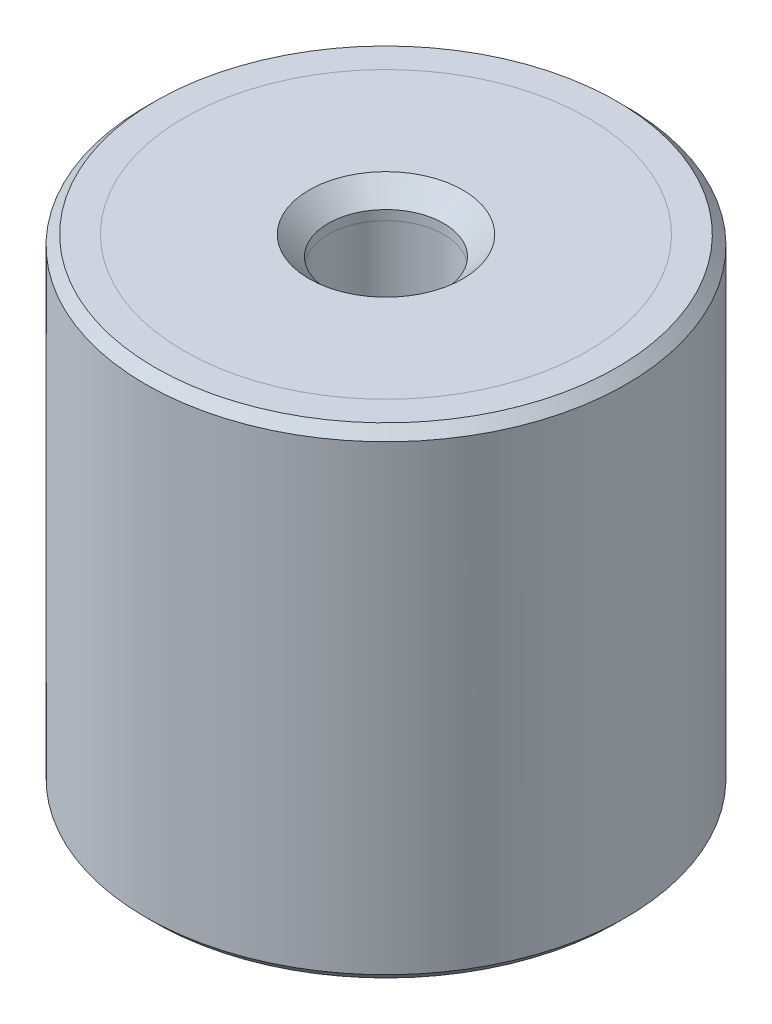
ISO-10303-21;
HEADER;
FILE_DESCRIPTION(('STEP AP214'),'2;1');
FILE_NAME('part.step','',(''),(''),'','','');
FILE_SCHEMA(('AUTOMOTIVE_DESIGN { 1 0 10303 214 1 1 1 1 }'));
ENDSEC;
DATA;
#1=APPLICATION_CONTEXT('core data for automotive mechanical design processes');
#2=APPLICATION_PROTOCOL_DEFINITION('international standard','automotive_design',2000,#1);
#3=PRODUCT_CONTEXT('',#1,'mechanical');
#4=PRODUCT('Part','Part','',(#3));
#5=PRODUCT_RELATED_PRODUCT_CATEGORY('part','',(#4));
#6=PRODUCT_DEFINITION_FORMATION('','',#4);
#7=PRODUCT_DEFINITION_CONTEXT('part definition',#1,'design');
#8=PRODUCT_DEFINITION('design','',#6,#7);
#9=PRODUCT_DEFINITION_SHAPE('','',#8);
#10=(LENGTH_UNIT() NAMED_UNIT(*) SI_UNIT(.MILLI.,.METRE.));
#11=(NAMED_UNIT(*) PLANE_ANGLE_UNIT() SI_UNIT($,.RADIAN.));
#12=(NAMED_UNIT(*) SI_UNIT($,.STERADIAN.) SOLID_ANGLE_UNIT());
#13=UNCERTAINTY_MEASURE_WITH_UNIT(LENGTH_MEASURE(1.E-05),#10,'distance_accuracy_value','');
#14=(GEOMETRIC_REPRESENTATION_CONTEXT(3) GLOBAL_UNCERTAINTY_ASSIGNED_CONTEXT((#13)) GLOBAL_UNIT_ASSIGNED_CONTEXT((#10,
#11,#12)) REPRESENTATION_CONTEXT('',''));
#15=CARTESIAN_POINT('',(0.,0.,0.));
#16=DIRECTION('',(0.,0.,1.));
#17=DIRECTION('',(1.,0.,0.));
#18=AXIS2_PLACEMENT_3D('',#15,#16,#17);
#19=CARTESIAN_POINT('',(0.,46.0340428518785,0.));
#20=DIRECTION('',(0.,1.,0.));
#21=DIRECTION('',(0.,0.,1.));
#22=AXIS2_PLACEMENT_3D('',#19,#20,#21);
#23=CYLINDRICAL_SURFACE('',#22,3.);
#24=CARTESIAN_POINT('',(0.,-22.5,0.));
#25=DIRECTION('',(0.,-1.,0.));
#26=DIRECTION('',(0.,0.,-1.));
#27=AXIS2_PLACEMENT_3D('',#24,#25,#26);
#28=CIRCLE('',#27,3.);
#29=CARTESIAN_POINT('',(0.,-22.5,-3.));
#30=VERTEX_POINT('',#29);
#31=EDGE_CURVE('P0_E10',#30,#30,#28,.T.);
#32=ORIENTED_EDGE('',*,*,#31,.T.);
#33=EDGE_LOOP('',(#32));
#34=FACE_BOUND('',#33,.T.);
#35=CARTESIAN_POINT('',(0.,-22.,0.));
#36=DIRECTION('',(0.,1.,0.));
#37=DIRECTION('',(0.,0.,1.));
#38=AXIS2_PLACEMENT_3D('',#35,#36,#37);
#39=CIRCLE('',#38,3.);
#40=CARTESIAN_POINT('',(0.,-22.,3.));
#41=VERTEX_POINT('',#40);
#42=EDGE_CURVE('P0_E25',#41,#41,#39,.T.);
#43=ORIENTED_EDGE('',*,*,#42,.T.);
#44=EDGE_LOOP('',(#43));
#45=FACE_BOUND('',#44,.T.);
#46=ADVANCED_FACE('P0_F14',(#34,#45),#23,.F.);
#47=CARTESIAN_POINT('',(0.,-22.,3.));
#48=DIRECTION('',(0.,1.,0.));
#49=DIRECTION('',(0.,0.,1.));
#50=AXIS2_PLACEMENT_3D('',#47,#48,#49);
#51=PLANE('',#50);
#52=CARTESIAN_POINT('',(0.,-22.,0.));
#53=DIRECTION('',(0.,1.,0.));
#54=DIRECTION('',(0.,0.,1.));
#55=AXIS2_PLACEMENT_3D('',#52,#53,#54);
#56=CIRCLE('',#55,10.5);
#57=CARTESIAN_POINT('',(0.,-22.,10.5));
#58=VERTEX_POINT('',#57);
#59=EDGE_CURVE('P0_E29',#58,#58,#56,.T.);
#60=ORIENTED_EDGE('',*,*,#59,.T.);
#61=EDGE_LOOP('',(#60));
#62=FACE_BOUND('',#61,.T.);
#63=ORIENTED_EDGE('',*,*,#42,.F.);
#64=EDGE_LOOP('',(#63));
#65=FACE_BOUND('',#64,.T.);
#66=ADVANCED_FACE('P0_F50',(#62,#65),#51,.T.);
#67=CARTESIAN_POINT('',(0.,46.0340428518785,0.));
#68=DIRECTION('',(0.,1.,0.));
#69=DIRECTION('',(0.,0.,1.));
#70=AXIS2_PLACEMENT_3D('',#67,#68,#69);
#71=CYLINDRICAL_SURFACE('',#70,10.5);
#72=CARTESIAN_POINT('',(0.,-23.5,0.));
#73=DIRECTION('',(0.,1.,0.));
#74=DIRECTION('',(0.,0.,1.));
#75=AXIS2_PLACEMENT_3D('',#72,#73,#74);
#76=CIRCLE('',#75,10.5);
#77=CARTESIAN_POINT('',(0.,-23.5,10.5));
#78=VERTEX_POINT('',#77);
#79=EDGE_CURVE('P0_E34',#78,#78,#76,.T.);
#80=ORIENTED_EDGE('',*,*,#79,.T.);
#81=EDGE_LOOP('',(#80));
#82=FACE_BOUND('',#81,.T.);
#83=ORIENTED_EDGE('',*,*,#59,.F.);
#84=EDGE_LOOP('',(#83));
#85=FACE_BOUND('',#84,.T.);
#86=ADVANCED_FACE('P0_F38',(#82,#85),#71,.T.);
#87=CARTESIAN_POINT('',(0.,-23.5,10.5));
#88=DIRECTION('',(0.,-1.,0.));
#89=DIRECTION('',(0.,0.,-1.));
#90=AXIS2_PLACEMENT_3D('',#87,#88,#89);
#91=PLANE('',#90);
#92=CARTESIAN_POINT('',(0.,-23.5,0.));
#93=DIRECTION('',(0.,-1.,0.));
#94=DIRECTION('',(0.,0.,-1.));
#95=AXIS2_PLACEMENT_3D('',#92,#93,#94);
#96=CIRCLE('',#95,4.);
#97=CARTESIAN_POINT('',(0.,-23.5,-4.));
#98=VERTEX_POINT('',#97);
#99=EDGE_CURVE('P0_E21',#98,#98,#96,.F.);
#100=ORIENTED_EDGE('',*,*,#99,.T.);
#101=EDGE_LOOP('',(#100));
#102=FACE_BOUND('',#101,.T.);
#103=ORIENTED_EDGE('',*,*,#79,.F.);
#104=EDGE_LOOP('',(#103));
#105=FACE_BOUND('',#104,.T.);
#106=ADVANCED_FACE('P0_F41',(#102,#105),#91,.T.);
#107=CARTESIAN_POINT('',(0.,-23.5,0.));
#108=DIRECTION('',(0.,-1.,0.));
#109=DIRECTION('',(0.,0.,-1.));
#110=AXIS2_PLACEMENT_3D('',#107,#108,#109);
#111=CONICAL_SURFACE('',#110,4.,0.785398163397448);
#112=ORIENTED_EDGE('',*,*,#31,.F.);
#113=EDGE_LOOP('',(#112));
#114=FACE_BOUND('',#113,.T.);
#115=ORIENTED_EDGE('',*,*,#99,.F.);
#116=EDGE_LOOP('',(#115));
#117=FACE_BOUND('',#116,.T.);
#118=ADVANCED_FACE('P0_F16',(#114,#117),#111,.F.);
#119=CLOSED_SHELL('',(#46,#66,#86,#106,#118));
#120=MANIFOLD_SOLID_BREP('P0_B1',#119);
#121=CARTESIAN_POINT('',(0.,69.5340428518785,0.));
#122=DIRECTION('',(0.,1.,0.));
#123=DIRECTION('',(0.,0.,1.));
#124=AXIS2_PLACEMENT_3D('',#121,#122,#123);
#125=CYLINDRICAL_SURFACE('',#124,3.);
#126=CARTESIAN_POINT('',(0.,0.5,0.));
#127=DIRECTION('',(0.,1.,0.));
#128=DIRECTION('',(0.,0.,1.));
#129=AXIS2_PLACEMENT_3D('',#126,#127,#128);
#130=CIRCLE('',#129,3.);
#131=CARTESIAN_POINT('',(0.,0.5,3.));
#132=VERTEX_POINT('',#131);
#133=EDGE_CURVE('P1_E21',#132,#132,#130,.T.);
#134=ORIENTED_EDGE('',*,*,#133,.T.);
#135=EDGE_LOOP('',(#134));
#136=FACE_BOUND('',#135,.T.);
#137=CARTESIAN_POINT('',(0.,0.,0.));
#138=DIRECTION('',(0.,1.,0.));
#139=DIRECTION('',(0.,0.,1.));
#140=AXIS2_PLACEMENT_3D('',#137,#138,#139);
#141=CIRCLE('',#140,3.);
#142=CARTESIAN_POINT('',(0.,0.,3.));
#143=VERTEX_POINT('',#142);
#144=EDGE_CURVE('P1_E34',#143,#143,#141,.T.);
#145=ORIENTED_EDGE('',*,*,#144,.F.);
#146=EDGE_LOOP('',(#145));
#147=FACE_BOUND('',#146,.T.);
#148=ADVANCED_FACE('P1_F14',(#136,#147),#125,.F.);
#149=CARTESIAN_POINT('',(0.,1.5,3.));
#150=DIRECTION('',(0.,1.,0.));
#151=DIRECTION('',(0.,0.,1.));
#152=AXIS2_PLACEMENT_3D('',#149,#150,#151);
#153=PLANE('',#152);
#154=CARTESIAN_POINT('',(0.,1.5,0.));
#155=DIRECTION('',(0.,1.,0.));
#156=DIRECTION('',(0.,0.,1.));
#157=AXIS2_PLACEMENT_3D('',#154,#155,#156);
#158=CIRCLE('',#157,4.);
#159=CARTESIAN_POINT('',(0.,1.5,4.));
#160=VERTEX_POINT('',#159);
#161=EDGE_CURVE('P1_E10',#160,#160,#158,.F.);
#162=ORIENTED_EDGE('',*,*,#161,.T.);
#163=EDGE_LOOP('',(#162));
#164=FACE_BOUND('',#163,.T.);
#165=CARTESIAN_POINT('',(0.,1.5,0.));
#166=DIRECTION('',(0.,1.,0.));
#167=DIRECTION('',(0.,0.,1.));
#168=AXIS2_PLACEMENT_3D('',#165,#166,#167);
#169=CIRCLE('',#168,10.5);
#170=CARTESIAN_POINT('',(0.,1.5,10.5));
#171=VERTEX_POINT('',#170);
#172=EDGE_CURVE('P1_E25',#171,#171,#169,.T.);
#173=ORIENTED_EDGE('',*,*,#172,.T.);
#174=EDGE_LOOP('',(#173));
#175=FACE_BOUND('',#174,.T.);
#176=ADVANCED_FACE('P1_F42',(#164,#175),#153,.T.);
#177=CARTESIAN_POINT('',(0.,69.5340428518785,0.));
#178=DIRECTION('',(0.,1.,0.));
#179=DIRECTION('',(0.,0.,1.));
#180=AXIS2_PLACEMENT_3D('',#177,#178,#179);
#181=CYLINDRICAL_SURFACE('',#180,10.5);
#182=CARTESIAN_POINT('',(0.,0.,0.));
#183=DIRECTION('',(0.,1.,0.));
#184=DIRECTION('',(0.,0.,1.));
#185=AXIS2_PLACEMENT_3D('',#182,#183,#184);
#186=CIRCLE('',#185,10.5);
#187=CARTESIAN_POINT('',(0.,0.,10.5));
#188=VERTEX_POINT('',#187);
#189=EDGE_CURVE('P1_E29',#188,#188,#186,.T.);
#190=ORIENTED_EDGE('',*,*,#189,.T.);
#191=EDGE_LOOP('',(#190));
#192=FACE_BOUND('',#191,.T.);
#193=ORIENTED_EDGE('',*,*,#172,.F.);
#194=EDGE_LOOP('',(#193));
#195=FACE_BOUND('',#194,.T.);
#196=ADVANCED_FACE('P1_F47',(#192,#195),#181,.T.);
#197=CARTESIAN_POINT('',(0.,0.,10.5));
#198=DIRECTION('',(0.,-1.,0.));
#199=DIRECTION('',(0.,0.,-1.));
#200=AXIS2_PLACEMENT_3D('',#197,#198,#199);
#201=PLANE('',#200);
#202=ORIENTED_EDGE('',*,*,#144,.T.);
#203=EDGE_LOOP('',(#202));
#204=FACE_BOUND('',#203,.T.);
#205=ORIENTED_EDGE('',*,*,#189,.F.);
#206=EDGE_LOOP('',(#205));
#207=FACE_BOUND('',#206,.T.);
#208=ADVANCED_FACE('P1_F38',(#204,#207),#201,.T.);
#209=CARTESIAN_POINT('',(0.,0.5,0.));
#210=DIRECTION('',(0.,1.,0.));
#211=DIRECTION('',(0.,0.,1.));
#212=AXIS2_PLACEMENT_3D('',#209,#210,#211);
#213=CONICAL_SURFACE('',#212,3.,0.78539816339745);
#214=ORIENTED_EDGE('',*,*,#161,.F.);
#215=EDGE_LOOP('',(#214));
#216=FACE_BOUND('',#215,.T.);
#217=ORIENTED_EDGE('',*,*,#133,.F.);
#218=EDGE_LOOP('',(#217));
#219=FACE_BOUND('',#218,.T.);
#220=ADVANCED_FACE('P1_F16',(#216,#219),#213,.F.);
#221=CLOSED_SHELL('',(#148,#176,#196,#208,#220));
#222=MANIFOLD_SOLID_BREP('P1_B1',#221);
#223=CARTESIAN_POINT('',(0.,0.,0.));
#224=DIRECTION('',(0.,1.,0.));
#225=DIRECTION('',(0.,0.,1.));
#226=AXIS2_PLACEMENT_3D('',#223,#224,#225);
#227=PLANE('',#226);
#228=CARTESIAN_POINT('',(0.,0.,0.));
#229=DIRECTION('',(0.,1.,0.));
#230=DIRECTION('',(0.,0.,1.));
#231=AXIS2_PLACEMENT_3D('',#228,#229,#230);
#232=CIRCLE('',#231,3.);
#233=CARTESIAN_POINT('',(0.,0.,3.));
#234=VERTEX_POINT('',#233);
#235=EDGE_CURVE('P2_E46',#234,#234,#232,.T.);
#236=ORIENTED_EDGE('',*,*,#235,.F.);
#237=EDGE_LOOP('',(#236));
#238=FACE_BOUND('',#237,.T.);
#239=CARTESIAN_POINT('',(0.,0.,0.));
#240=DIRECTION('',(0.,1.,0.));
#241=DIRECTION('',(0.,0.,1.));
#242=AXIS2_PLACEMENT_3D('',#239,#240,#241);
#243=CIRCLE('',#242,10.5);
#244=CARTESIAN_POINT('',(0.,0.,10.5));
#245=VERTEX_POINT('',#244);
#246=EDGE_CURVE('P2_E33',#245,#245,#243,.T.);
#247=ORIENTED_EDGE('',*,*,#246,.T.);
#248=EDGE_LOOP('',(#247));
#249=FACE_BOUND('',#248,.T.);
#250=ADVANCED_FACE('P2_F13',(#238,#249),#227,.T.);
#251=CARTESIAN_POINT('',(0.,65.5134936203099,0.));
#252=DIRECTION('',(0.,1.,0.));
#253=DIRECTION('',(0.,0.,1.));
#254=AXIS2_PLACEMENT_3D('',#251,#252,#253);
#255=CYLINDRICAL_SURFACE('',#254,10.5);
#256=CARTESIAN_POINT('',(0.,1.5,0.));
#257=DIRECTION('',(0.,1.,0.));
#258=DIRECTION('',(0.,0.,1.));
#259=AXIS2_PLACEMENT_3D('',#256,#257,#258);
#260=CIRCLE('',#259,10.5);
#261=CARTESIAN_POINT('',(0.,1.5,10.5));
#262=VERTEX_POINT('',#261);
#263=EDGE_CURVE('P2_E36',#262,#262,#260,.T.);
#264=ORIENTED_EDGE('',*,*,#263,.T.);
#265=EDGE_LOOP('',(#264));
#266=FACE_BOUND('',#265,.T.);
#267=ORIENTED_EDGE('',*,*,#246,.F.);
#268=EDGE_LOOP('',(#267));
#269=FACE_BOUND('',#268,.T.);
#270=ADVANCED_FACE('P2_F92',(#266,#269),#255,.F.);
#271=CARTESIAN_POINT('',(0.,1.5,10.5));
#272=DIRECTION('',(0.,1.,0.));
#273=DIRECTION('',(0.,0.,1.));
#274=AXIS2_PLACEMENT_3D('',#271,#272,#273);
#275=PLANE('',#274);
#276=CARTESIAN_POINT('',(0.,1.5,0.));
#277=DIRECTION('',(0.,1.,0.));
#278=DIRECTION('',(0.,0.,1.));
#279=AXIS2_PLACEMENT_3D('',#276,#277,#278);
#280=CIRCLE('',#279,12.);
#281=CARTESIAN_POINT('',(0.,1.5,12.));
#282=VERTEX_POINT('',#281);
#283=EDGE_CURVE('P2_E9',#282,#282,#280,.T.);
#284=ORIENTED_EDGE('',*,*,#283,.T.);
#285=EDGE_LOOP('',(#284));
#286=FACE_BOUND('',#285,.T.);
#287=ORIENTED_EDGE('',*,*,#263,.F.);
#288=EDGE_LOOP('',(#287));
#289=FACE_BOUND('',#288,.T.);
#290=ADVANCED_FACE('P2_F88',(#286,#289),#275,.T.);
#291=CARTESIAN_POINT('',(0.,65.5134936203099,0.));
#292=DIRECTION('',(0.,1.,0.));
#293=DIRECTION('',(0.,0.,1.));
#294=AXIS2_PLACEMENT_3D('',#291,#292,#293);
#295=CYLINDRICAL_SURFACE('',#294,12.5);
#296=CARTESIAN_POINT('',(0.,-23.,0.));
#297=DIRECTION('',(0.,-1.,0.));
#298=DIRECTION('',(0.,0.,-1.));
#299=AXIS2_PLACEMENT_3D('',#296,#297,#298);
#300=CIRCLE('',#299,12.5);
#301=CARTESIAN_POINT('',(0.,-23.,-12.5));
#302=VERTEX_POINT('',#301);
#303=EDGE_CURVE('P2_E24',#302,#302,#300,.F.);
#304=ORIENTED_EDGE('',*,*,#303,.T.);
#305=EDGE_LOOP('',(#304));
#306=FACE_BOUND('',#305,.T.);
#307=CARTESIAN_POINT('',(0.,1.,0.));
#308=DIRECTION('',(0.,1.,0.));
#309=DIRECTION('',(0.,0.,1.));
#310=AXIS2_PLACEMENT_3D('',#307,#308,#309);
#311=CIRCLE('',#310,12.5);
#312=CARTESIAN_POINT('',(0.,1.,12.5));
#313=VERTEX_POINT('',#312);
#314=EDGE_CURVE('P2_E28',#313,#313,#311,.F.);
#315=ORIENTED_EDGE('',*,*,#314,.T.);
#316=EDGE_LOOP('',(#315));
#317=FACE_BOUND('',#316,.T.);
#318=ADVANCED_FACE('P2_F82',(#306,#317),#295,.T.);
#319=CARTESIAN_POINT('',(0.,-23.5,12.5));
#320=DIRECTION('',(0.,-1.,0.));
#321=DIRECTION('',(0.,0.,-1.));
#322=AXIS2_PLACEMENT_3D('',#319,#320,#321);
#323=PLANE('',#322);
#324=CARTESIAN_POINT('',(0.,-23.5,0.));
#325=DIRECTION('',(0.,-1.,0.));
#326=DIRECTION('',(0.,0.,-1.));
#327=AXIS2_PLACEMENT_3D('',#324,#325,#326);
#328=CIRCLE('',#327,12.);
#329=CARTESIAN_POINT('',(0.,-23.5,-12.));
#330=VERTEX_POINT('',#329);
#331=EDGE_CURVE('P2_E20',#330,#330,#328,.T.);
#332=ORIENTED_EDGE('',*,*,#331,.T.);
#333=EDGE_LOOP('',(#332));
#334=FACE_BOUND('',#333,.T.);
#335=CARTESIAN_POINT('',(0.,-23.5,0.));
#336=DIRECTION('',(0.,1.,0.));
#337=DIRECTION('',(0.,0.,1.));
#338=AXIS2_PLACEMENT_3D('',#335,#336,#337);
#339=CIRCLE('',#338,10.5);
#340=CARTESIAN_POINT('',(0.,-23.5,10.5));
#341=VERTEX_POINT('',#340);
#342=EDGE_CURVE('P2_E39',#341,#341,#339,.T.);
#343=ORIENTED_EDGE('',*,*,#342,.T.);
#344=EDGE_LOOP('',(#343));
#345=FACE_BOUND('',#344,.T.);
#346=ADVANCED_FACE('P2_F77',(#334,#345),#323,.T.);
#347=CARTESIAN_POINT('',(0.,65.5134936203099,0.));
#348=DIRECTION('',(0.,1.,0.));
#349=DIRECTION('',(0.,0.,1.));
#350=AXIS2_PLACEMENT_3D('',#347,#348,#349);
#351=CYLINDRICAL_SURFACE('',#350,10.5);
#352=CARTESIAN_POINT('',(0.,-22.,0.));
#353=DIRECTION('',(0.,1.,0.));
#354=DIRECTION('',(0.,0.,1.));
#355=AXIS2_PLACEMENT_3D('',#352,#353,#354);
#356=CIRCLE('',#355,10.5);
#357=CARTESIAN_POINT('',(0.,-22.,10.5));
#358=VERTEX_POINT('',#357);
#359=EDGE_CURVE('P2_E42',#358,#358,#356,.T.);
#360=ORIENTED_EDGE('',*,*,#359,.T.);
#361=EDGE_LOOP('',(#360));
#362=FACE_BOUND('',#361,.T.);
#363=ORIENTED_EDGE('',*,*,#342,.F.);
#364=EDGE_LOOP('',(#363));
#365=FACE_BOUND('',#364,.T.);
#366=ADVANCED_FACE('P2_F71',(#362,#365),#351,.F.);
#367=CARTESIAN_POINT('',(0.,-22.,10.5));
#368=DIRECTION('',(0.,-1.,0.));
#369=DIRECTION('',(0.,0.,-1.));
#370=AXIS2_PLACEMENT_3D('',#367,#368,#369);
#371=PLANE('',#370);
#372=CARTESIAN_POINT('',(0.,-22.,0.));
#373=DIRECTION('',(0.,-1.,0.));
#374=DIRECTION('',(0.,0.,-1.));
#375=AXIS2_PLACEMENT_3D('',#372,#373,#374);
#376=CIRCLE('',#375,3.);
#377=CARTESIAN_POINT('',(0.,-22.,-3.));
#378=VERTEX_POINT('',#377);
#379=EDGE_CURVE('P2_E52',#378,#378,#376,.T.);
#380=ORIENTED_EDGE('',*,*,#379,.F.);
#381=EDGE_LOOP('',(#380));
#382=FACE_BOUND('',#381,.T.);
#383=ORIENTED_EDGE('',*,*,#359,.F.);
#384=EDGE_LOOP('',(#383));
#385=FACE_BOUND('',#384,.T.);
#386=ADVANCED_FACE('P2_F67',(#382,#385),#371,.T.);
#387=CARTESIAN_POINT('',(0.,-23.,0.));
#388=DIRECTION('',(0.,1.,0.));
#389=DIRECTION('',(0.,0.,1.));
#390=AXIS2_PLACEMENT_3D('',#387,#388,#389);
#391=CONICAL_SURFACE('',#390,12.5,0.78539816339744);
#392=ORIENTED_EDGE('',*,*,#331,.F.);
#393=EDGE_LOOP('',(#392));
#394=FACE_BOUND('',#393,.T.);
#395=ORIENTED_EDGE('',*,*,#303,.F.);
#396=EDGE_LOOP('',(#395));
#397=FACE_BOUND('',#396,.T.);
#398=ADVANCED_FACE('P2_F70',(#394,#397),#391,.T.);
#399=CARTESIAN_POINT('',(0.,1.5,0.));
#400=DIRECTION('',(0.,-1.,0.));
#401=DIRECTION('',(0.,0.,-1.));
#402=AXIS2_PLACEMENT_3D('',#399,#400,#401);
#403=CONICAL_SURFACE('',#402,12.,0.785398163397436);
#404=ORIENTED_EDGE('',*,*,#314,.F.);
#405=EDGE_LOOP('',(#404));
#406=FACE_BOUND('',#405,.T.);
#407=ORIENTED_EDGE('',*,*,#283,.F.);
#408=EDGE_LOOP('',(#407));
#409=FACE_BOUND('',#408,.T.);
#410=ADVANCED_FACE('P2_F15',(#406,#409),#403,.T.);
#411=CARTESIAN_POINT('',(0.,-4.5,0.));
#412=DIRECTION('',(0.,1.,0.));
#413=DIRECTION('',(0.,0.,1.));
#414=AXIS2_PLACEMENT_3D('',#411,#412,#413);
#415=CYLINDRICAL_SURFACE('',#414,3.);
#416=CARTESIAN_POINT('',(0.,-4.5,0.));
#417=DIRECTION('',(0.,1.,0.));
#418=DIRECTION('',(0.,0.,1.));
#419=AXIS2_PLACEMENT_3D('',#416,#417,#418);
#420=CIRCLE('',#419,3.);
#421=CARTESIAN_POINT('',(0.,-4.5,3.));
#422=VERTEX_POINT('',#421);
#423=EDGE_CURVE('P2_E45',#422,#422,#420,.T.);
#424=ORIENTED_EDGE('',*,*,#423,.F.);
#425=EDGE_LOOP('',(#424));
#426=FACE_BOUND('',#425,.T.);
#427=ORIENTED_EDGE('',*,*,#235,.T.);
#428=EDGE_LOOP('',(#427));
#429=FACE_BOUND('',#428,.T.);
#430=ADVANCED_FACE('P2_F108',(#426,#429),#415,.F.);
#431=CARTESIAN_POINT('',(0.,-4.5,0.));
#432=DIRECTION('',(0.,1.,0.));
#433=DIRECTION('',(0.,0.,1.));
#434=AXIS2_PLACEMENT_3D('',#431,#432,#433);
#435=PLANE('',#434);
#436=ORIENTED_EDGE('',*,*,#423,.T.);
#437=EDGE_LOOP('',(#436));
#438=FACE_BOUND('',#437,.T.);
#439=ADVANCED_FACE('P2_F63',(#438),#435,.T.);
#440=CARTESIAN_POINT('',(0.,-17.5,0.));
#441=DIRECTION('',(0.,-1.,0.));
#442=DIRECTION('',(0.,0.,-1.));
#443=AXIS2_PLACEMENT_3D('',#440,#441,#442);
#444=CYLINDRICAL_SURFACE('',#443,3.);
#445=CARTESIAN_POINT('',(0.,-17.5,0.));
#446=DIRECTION('',(0.,-1.,0.));
#447=DIRECTION('',(0.,0.,-1.));
#448=AXIS2_PLACEMENT_3D('',#445,#446,#447);
#449=CIRCLE('',#448,3.);
#450=CARTESIAN_POINT('',(0.,-17.5,-3.));
#451=VERTEX_POINT('',#450);
#452=EDGE_CURVE('P2_E49',#451,#451,#449,.T.);
#453=ORIENTED_EDGE('',*,*,#452,.F.);
#454=EDGE_LOOP('',(#453));
#455=FACE_BOUND('',#454,.T.);
#456=ORIENTED_EDGE('',*,*,#379,.T.);
#457=EDGE_LOOP('',(#456));
#458=FACE_BOUND('',#457,.T.);
#459=ADVANCED_FACE('P2_F60',(#455,#458),#444,.F.);
#460=CARTESIAN_POINT('',(0.,-17.5,0.));
#461=DIRECTION('',(0.,-1.,0.));
#462=DIRECTION('',(0.,0.,-1.));
#463=AXIS2_PLACEMENT_3D('',#460,#461,#462);
#464=PLANE('',#463);
#465=ORIENTED_EDGE('',*,*,#452,.T.);
#466=EDGE_LOOP('',(#465));
#467=FACE_BOUND('',#466,.T.);
#468=ADVANCED_FACE('P2_F58',(#467),#464,.T.);
#469=CLOSED_SHELL('',(#250,#270,#290,#318,#346,#366,#386,#398,#410,#430,#439,#459,#468));
#470=MANIFOLD_SOLID_BREP('P2_B1',#469);
#471=ADVANCED_BREP_SHAPE_REPRESENTATION('',(#18,#120,#222,#470),#14);
#472=SHAPE_DEFINITION_REPRESENTATION(#9,#471);
ENDSEC;
END-ISO-10303-21;
